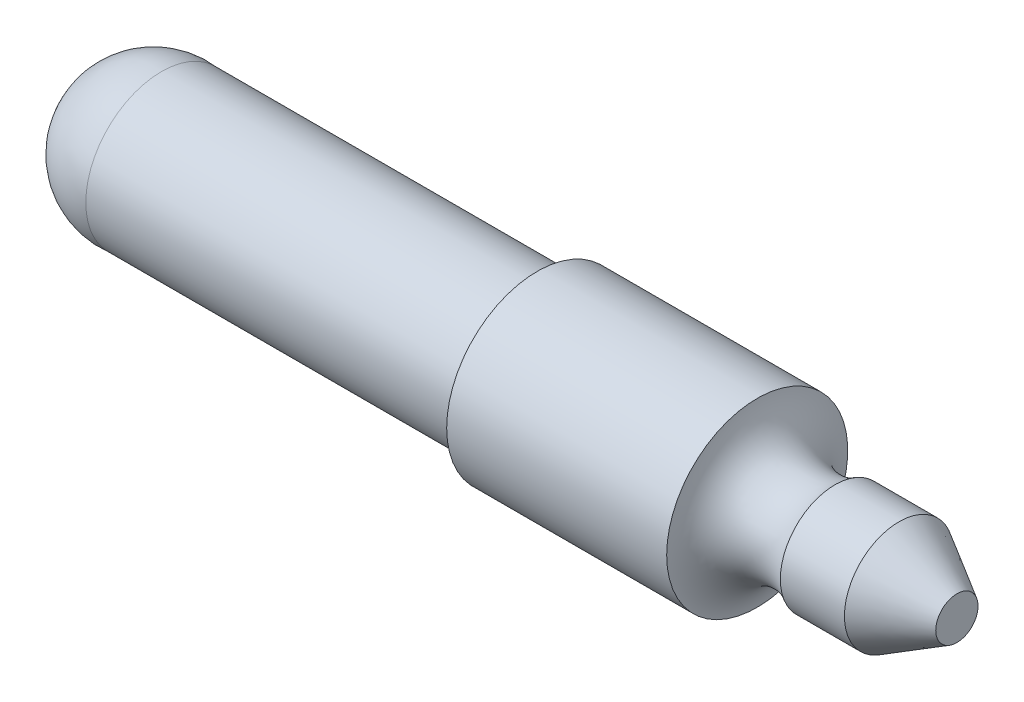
ISO-10303-21;
HEADER;
FILE_DESCRIPTION(('STEP AP214'),'2;1');
FILE_NAME('part.step','',(''),(''),'','','');
FILE_SCHEMA(('AUTOMOTIVE_DESIGN { 1 0 10303 214 1 1 1 1 }'));
ENDSEC;
DATA;
#1=APPLICATION_CONTEXT('core data for automotive mechanical design processes');
#2=APPLICATION_PROTOCOL_DEFINITION('international standard','automotive_design',2000,#1);
#3=PRODUCT_CONTEXT('',#1,'mechanical');
#4=PRODUCT('Part','Part','',(#3));
#5=PRODUCT_RELATED_PRODUCT_CATEGORY('part','',(#4));
#6=PRODUCT_DEFINITION_FORMATION('','',#4);
#7=PRODUCT_DEFINITION_CONTEXT('part definition',#1,'design');
#8=PRODUCT_DEFINITION('design','',#6,#7);
#9=PRODUCT_DEFINITION_SHAPE('','',#8);
#10=(LENGTH_UNIT() NAMED_UNIT(*) SI_UNIT(.MILLI.,.METRE.));
#11=(NAMED_UNIT(*) PLANE_ANGLE_UNIT() SI_UNIT($,.RADIAN.));
#12=(NAMED_UNIT(*) SI_UNIT($,.STERADIAN.) SOLID_ANGLE_UNIT());
#13=UNCERTAINTY_MEASURE_WITH_UNIT(LENGTH_MEASURE(1.E-05),#10,'distance_accuracy_value','');
#14=(GEOMETRIC_REPRESENTATION_CONTEXT(3) GLOBAL_UNCERTAINTY_ASSIGNED_CONTEXT((#13)) GLOBAL_UNIT_ASSIGNED_CONTEXT((#10,
#11,#12)) REPRESENTATION_CONTEXT('',''));
#15=CARTESIAN_POINT('',(0.,0.,0.));
#16=DIRECTION('',(0.,0.,1.));
#17=DIRECTION('',(1.,0.,0.));
#18=AXIS2_PLACEMENT_3D('',#15,#16,#17);
#19=CARTESIAN_POINT('',(0.,0.,0.));
#20=DIRECTION('',(-1.,0.,0.));
#21=DIRECTION('',(0.,1.,0.));
#22=AXIS2_PLACEMENT_3D('',#19,#20,#21);
#23=SPHERICAL_SURFACE('',#22,1.143);
#24=CARTESIAN_POINT('',(0.1203153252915,0.,0.));
#25=DIRECTION('',(-1.,0.,0.));
#26=DIRECTION('',(0.,0.,1.));
#27=AXIS2_PLACEMENT_3D('',#24,#25,#26);
#28=CIRCLE('',#27,1.13665);
#29=CARTESIAN_POINT('',(0.1203153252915,0.,1.13665));
#30=VERTEX_POINT('',#29);
#31=EDGE_CURVE('E10',#30,#30,#28,.T.);
#32=ORIENTED_EDGE('',*,*,#31,.T.);
#33=EDGE_LOOP('',(#32));
#34=FACE_BOUND('',#33,.T.);
#35=ADVANCED_FACE('F30',(#34),#23,.T.);
#36=CARTESIAN_POINT('',(0.,0.,0.));
#37=DIRECTION('',(-1.,0.,0.));
#38=DIRECTION('',(0.,0.,1.));
#39=AXIS2_PLACEMENT_3D('',#36,#37,#38);
#40=CYLINDRICAL_SURFACE('',#39,1.13665);
#41=ORIENTED_EDGE('',*,*,#31,.F.);
#42=EDGE_LOOP('',(#41));
#43=FACE_BOUND('',#42,.T.);
#44=CARTESIAN_POINT('',(5.7591153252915,0.,0.));
#45=DIRECTION('',(-1.,0.,0.));
#46=DIRECTION('',(0.,0.,1.));
#47=AXIS2_PLACEMENT_3D('',#44,#45,#46);
#48=CIRCLE('',#47,1.13665);
#49=CARTESIAN_POINT('',(5.7591153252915,0.,1.13665));
#50=VERTEX_POINT('',#49);
#51=EDGE_CURVE('E36',#50,#50,#48,.T.);
#52=ORIENTED_EDGE('',*,*,#51,.T.);
#53=EDGE_LOOP('',(#52));
#54=FACE_BOUND('',#53,.T.);
#55=ADVANCED_FACE('F71',(#43,#54),#40,.T.);
#56=CARTESIAN_POINT('',(5.7591153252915,1.13665,0.));
#57=DIRECTION('',(1.,0.,0.));
#58=DIRECTION('',(0.,0.,-1.));
#59=AXIS2_PLACEMENT_3D('',#56,#57,#58);
#60=PLANE('',#59);
#61=ORIENTED_EDGE('',*,*,#51,.F.);
#62=EDGE_LOOP('',(#61));
#63=FACE_BOUND('',#62,.T.);
#64=CARTESIAN_POINT('',(5.7591153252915,0.,0.));
#65=DIRECTION('',(-1.,0.,0.));
#66=DIRECTION('',(0.,0.,1.));
#67=AXIS2_PLACEMENT_3D('',#64,#65,#66);
#68=CIRCLE('',#67,1.3589);
#69=CARTESIAN_POINT('',(5.7591153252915,0.,1.3589));
#70=VERTEX_POINT('',#69);
#71=EDGE_CURVE('E40',#70,#70,#68,.T.);
#72=ORIENTED_EDGE('',*,*,#71,.T.);
#73=EDGE_LOOP('',(#72));
#74=FACE_BOUND('',#73,.T.);
#75=ADVANCED_FACE('F75',(#63,#74),#60,.F.);
#76=CARTESIAN_POINT('',(0.,0.,0.));
#77=DIRECTION('',(-1.,0.,0.));
#78=DIRECTION('',(0.,0.,1.));
#79=AXIS2_PLACEMENT_3D('',#76,#77,#78);
#80=CYLINDRICAL_SURFACE('',#79,1.3589);
#81=ORIENTED_EDGE('',*,*,#71,.F.);
#82=EDGE_LOOP('',(#81));
#83=FACE_BOUND('',#82,.T.);
#84=CARTESIAN_POINT('',(9.0611153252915,0.,0.));
#85=DIRECTION('',(-1.,0.,0.));
#86=DIRECTION('',(0.,0.,1.));
#87=AXIS2_PLACEMENT_3D('',#84,#85,#86);
#88=CIRCLE('',#87,1.3589);
#89=CARTESIAN_POINT('',(9.0611153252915,0.,1.3589));
#90=VERTEX_POINT('',#89);
#91=EDGE_CURVE('E44',#90,#90,#88,.T.);
#92=ORIENTED_EDGE('',*,*,#91,.T.);
#93=EDGE_LOOP('',(#92));
#94=FACE_BOUND('',#93,.T.);
#95=ADVANCED_FACE('F80',(#83,#94),#80,.T.);
#96=CARTESIAN_POINT('',(9.81631161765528,0.,0.));
#97=DIRECTION('',(-1.,0.,0.));
#98=DIRECTION('',(0.,0.,1.));
#99=AXIS2_PLACEMENT_3D('',#96,#97,#98);
#100=TOROIDAL_SURFACE('',#99,1.4605,0.762);
#101=ORIENTED_EDGE('',*,*,#91,.F.);
#102=EDGE_LOOP('',(#101));
#103=FACE_BOUND('',#102,.T.);
#104=CARTESIAN_POINT('',(10.2277896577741,0.,0.));
#105=DIRECTION('',(-1.,0.,0.));
#106=DIRECTION('',(0.,0.,1.));
#107=AXIS2_PLACEMENT_3D('',#104,#105,#106);
#108=CIRCLE('',#107,0.81915);
#109=CARTESIAN_POINT('',(10.2277896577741,0.,0.81915));
#110=VERTEX_POINT('',#109);
#111=EDGE_CURVE('E49',#110,#110,#108,.T.);
#112=ORIENTED_EDGE('',*,*,#111,.T.);
#113=EDGE_LOOP('',(#112));
#114=FACE_BOUND('',#113,.T.);
#115=ADVANCED_FACE('F86',(#103,#114),#100,.F.);
#116=CARTESIAN_POINT('',(0.,0.,0.));
#117=DIRECTION('',(-1.,0.,0.));
#118=DIRECTION('',(0.,0.,1.));
#119=AXIS2_PLACEMENT_3D('',#116,#117,#118);
#120=CYLINDRICAL_SURFACE('',#119,0.81915);
#121=ORIENTED_EDGE('',*,*,#111,.F.);
#122=EDGE_LOOP('',(#121));
#123=FACE_BOUND('',#122,.T.);
#124=CARTESIAN_POINT('',(11.1894320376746,0.,0.));
#125=DIRECTION('',(-1.,0.,0.));
#126=DIRECTION('',(0.,0.,1.));
#127=AXIS2_PLACEMENT_3D('',#124,#125,#126);
#128=CIRCLE('',#127,0.81915);
#129=CARTESIAN_POINT('',(11.1894320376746,0.,0.81915));
#130=VERTEX_POINT('',#129);
#131=EDGE_CURVE('E52',#130,#130,#128,.T.);
#132=ORIENTED_EDGE('',*,*,#131,.T.);
#133=EDGE_LOOP('',(#132));
#134=FACE_BOUND('',#133,.T.);
#135=ADVANCED_FACE('F67',(#123,#134),#120,.T.);
#136=CARTESIAN_POINT('',(12.0583153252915,0.,0.));
#137=DIRECTION('',(-1.,0.,0.));
#138=DIRECTION('',(0.,0.,1.));
#139=AXIS2_PLACEMENT_3D('',#136,#137,#138);
#140=CONICAL_SURFACE('',#139,0.3175,0.5235987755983);
#141=ORIENTED_EDGE('',*,*,#131,.F.);
#142=EDGE_LOOP('',(#141));
#143=FACE_BOUND('',#142,.T.);
#144=CARTESIAN_POINT('',(12.0583153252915,0.,0.));
#145=DIRECTION('',(-1.,0.,0.));
#146=DIRECTION('',(0.,0.,1.));
#147=AXIS2_PLACEMENT_3D('',#144,#145,#146);
#148=CIRCLE('',#147,0.3175);
#149=CARTESIAN_POINT('',(12.0583153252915,0.,0.3175));
#150=VERTEX_POINT('',#149);
#151=EDGE_CURVE('E55',#150,#150,#148,.T.);
#152=ORIENTED_EDGE('',*,*,#151,.T.);
#153=EDGE_LOOP('',(#152));
#154=FACE_BOUND('',#153,.T.);
#155=ADVANCED_FACE('F59',(#143,#154),#140,.T.);
#156=CARTESIAN_POINT('',(12.0583153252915,0.3175,0.));
#157=DIRECTION('',(-1.,0.,0.));
#158=DIRECTION('',(0.,0.,1.));
#159=AXIS2_PLACEMENT_3D('',#156,#157,#158);
#160=PLANE('',#159);
#161=ORIENTED_EDGE('',*,*,#151,.F.);
#162=EDGE_LOOP('',(#161));
#163=FACE_BOUND('',#162,.T.);
#164=ADVANCED_FACE('F61',(#163),#160,.F.);
#165=CLOSED_SHELL('',(#35,#55,#75,#95,#115,#135,#155,#164));
#166=MANIFOLD_SOLID_BREP('B2',#165);
#167=ADVANCED_BREP_SHAPE_REPRESENTATION('',(#18,#166),#14);
#168=SHAPE_DEFINITION_REPRESENTATION(#9,#167);
ENDSEC;
END-ISO-10303-21;
